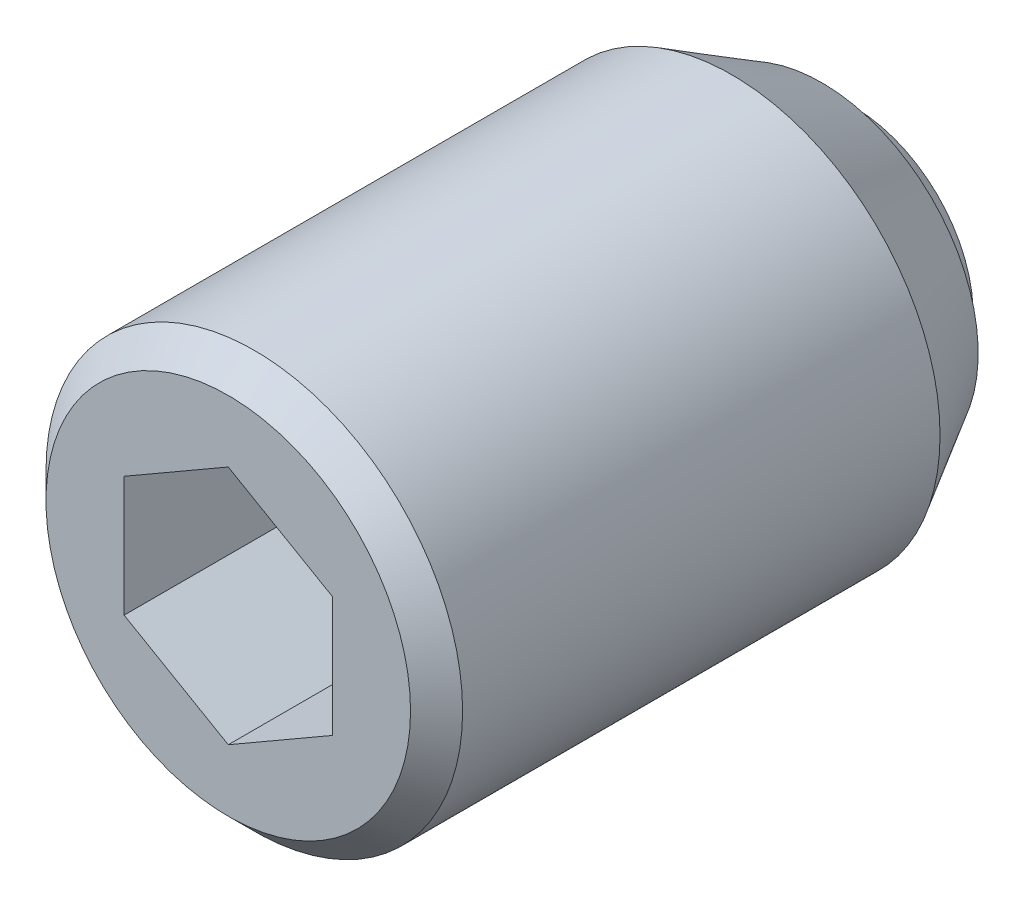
ISO-10303-21;
HEADER;
FILE_DESCRIPTION(('STEP AP214'),'2;1');
FILE_NAME('part.step','',(''),(''),'','','');
FILE_SCHEMA(('AUTOMOTIVE_DESIGN { 1 0 10303 214 1 1 1 1 }'));
ENDSEC;
DATA;
#1=APPLICATION_CONTEXT('core data for automotive mechanical design processes');
#2=APPLICATION_PROTOCOL_DEFINITION('international standard','automotive_design',2000,#1);
#3=PRODUCT_CONTEXT('',#1,'mechanical');
#4=PRODUCT('Part','Part','',(#3));
#5=PRODUCT_RELATED_PRODUCT_CATEGORY('part','',(#4));
#6=PRODUCT_DEFINITION_FORMATION('','',#4);
#7=PRODUCT_DEFINITION_CONTEXT('part definition',#1,'design');
#8=PRODUCT_DEFINITION('design','',#6,#7);
#9=PRODUCT_DEFINITION_SHAPE('','',#8);
#10=(LENGTH_UNIT() NAMED_UNIT(*) SI_UNIT(.MILLI.,.METRE.));
#11=(NAMED_UNIT(*) PLANE_ANGLE_UNIT() SI_UNIT($,.RADIAN.));
#12=(NAMED_UNIT(*) SI_UNIT($,.STERADIAN.) SOLID_ANGLE_UNIT());
#13=UNCERTAINTY_MEASURE_WITH_UNIT(LENGTH_MEASURE(1.E-05),#10,'distance_accuracy_value','');
#14=(GEOMETRIC_REPRESENTATION_CONTEXT(3) GLOBAL_UNCERTAINTY_ASSIGNED_CONTEXT((#13)) GLOBAL_UNIT_ASSIGNED_CONTEXT((#10,
#11,#12)) REPRESENTATION_CONTEXT('',''));
#15=CARTESIAN_POINT('',(0.,0.,0.));
#16=DIRECTION('',(0.,0.,1.));
#17=DIRECTION('',(1.,0.,0.));
#18=AXIS2_PLACEMENT_3D('',#15,#16,#17);
#19=CARTESIAN_POINT('',(2.,1.15470053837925,9.5));
#20=DIRECTION('',(0.5,0.86602540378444,0.));
#21=DIRECTION('',(0.86602540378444,-0.5,0.));
#22=AXIS2_PLACEMENT_3D('',#19,#20,#21);
#23=PLANE('',#22);
#24=DIRECTION('',(0.,0.,1.));
#25=VECTOR('',#24,1.);
#26=CARTESIAN_POINT('',(2.,1.15470053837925,9.5));
#27=LINE('',#26,#25);
#28=CARTESIAN_POINT('',(2.,1.15470053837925,8.));
#29=VERTEX_POINT('',#28);
#30=CARTESIAN_POINT('',(2.,1.15470053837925,12.));
#31=VERTEX_POINT('',#30);
#32=EDGE_CURVE('E68',#29,#31,#27,.T.);
#33=ORIENTED_EDGE('',*,*,#32,.T.);
#34=DIRECTION('',(-0.86602540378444,0.5,0.));
#35=VECTOR('',#34,1.);
#36=CARTESIAN_POINT('',(2.,1.15470053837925,12.));
#37=LINE('',#36,#35);
#38=CARTESIAN_POINT('',(0.,2.3094010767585,12.));
#39=VERTEX_POINT('',#38);
#40=EDGE_CURVE('E29',#31,#39,#37,.T.);
#41=ORIENTED_EDGE('',*,*,#40,.T.);
#42=DIRECTION('',(0.,0.,1.));
#43=VECTOR('',#42,1.);
#44=CARTESIAN_POINT('',(0.,2.3094010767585,9.5));
#45=LINE('',#44,#43);
#46=CARTESIAN_POINT('',(0.,2.3094010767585,8.));
#47=VERTEX_POINT('',#46);
#48=EDGE_CURVE('E80',#47,#39,#45,.T.);
#49=ORIENTED_EDGE('',*,*,#48,.F.);
#50=DIRECTION('',(-0.86602540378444,0.5,0.));
#51=VECTOR('',#50,1.);
#52=CARTESIAN_POINT('',(2.,1.15470053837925,8.));
#53=LINE('',#52,#51);
#54=EDGE_CURVE('E79',#29,#47,#53,.T.);
#55=ORIENTED_EDGE('',*,*,#54,.F.);
#56=EDGE_LOOP('',(#33,#41,#49,#55));
#57=FACE_BOUND('',#56,.T.);
#58=ADVANCED_FACE('F14',(#57),#23,.F.);
#59=CARTESIAN_POINT('',(2.,-1.15470053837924,9.5));
#60=DIRECTION('',(1.,0.,0.));
#61=DIRECTION('',(0.,0.,1.));
#62=AXIS2_PLACEMENT_3D('',#59,#60,#61);
#63=PLANE('',#62);
#64=DIRECTION('',(0.,0.,1.));
#65=VECTOR('',#64,1.);
#66=CARTESIAN_POINT('',(2.,-1.15470053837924,9.5));
#67=LINE('',#66,#65);
#68=CARTESIAN_POINT('',(2.,-1.15470053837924,8.));
#69=VERTEX_POINT('',#68);
#70=CARTESIAN_POINT('',(2.,-1.15470053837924,12.));
#71=VERTEX_POINT('',#70);
#72=EDGE_CURVE('E76',#69,#71,#67,.T.);
#73=ORIENTED_EDGE('',*,*,#72,.T.);
#74=DIRECTION('',(0.,1.,0.));
#75=VECTOR('',#74,1.);
#76=CARTESIAN_POINT('',(2.,-1.15470053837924,12.));
#77=LINE('',#76,#75);
#78=EDGE_CURVE('E75',#71,#31,#77,.T.);
#79=ORIENTED_EDGE('',*,*,#78,.T.);
#80=ORIENTED_EDGE('',*,*,#32,.F.);
#81=DIRECTION('',(0.,1.,0.));
#82=VECTOR('',#81,1.);
#83=CARTESIAN_POINT('',(2.,-1.15470053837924,8.));
#84=LINE('',#83,#82);
#85=EDGE_CURVE('E72',#69,#29,#84,.T.);
#86=ORIENTED_EDGE('',*,*,#85,.F.);
#87=EDGE_LOOP('',(#73,#79,#80,#86));
#88=FACE_BOUND('',#87,.T.);
#89=ADVANCED_FACE('F70',(#88),#63,.F.);
#90=CARTESIAN_POINT('',(2.,-1.15470053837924,9.5));
#91=DIRECTION('',(-0.5,0.866025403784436,0.));
#92=DIRECTION('',(0.866025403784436,0.5,0.));
#93=AXIS2_PLACEMENT_3D('',#90,#91,#92);
#94=PLANE('',#93);
#95=DIRECTION('',(0.,0.,1.));
#96=VECTOR('',#95,1.);
#97=CARTESIAN_POINT('',(0.,-2.30940107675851,9.5));
#98=LINE('',#97,#96);
#99=CARTESIAN_POINT('',(0.,-2.30940107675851,8.));
#100=VERTEX_POINT('',#99);
#101=CARTESIAN_POINT('',(0.,-2.30940107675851,12.));
#102=VERTEX_POINT('',#101);
#103=EDGE_CURVE('E122',#100,#102,#98,.T.);
#104=ORIENTED_EDGE('',*,*,#103,.T.);
#105=DIRECTION('',(-0.866025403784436,-0.5,0.));
#106=VECTOR('',#105,1.);
#107=CARTESIAN_POINT('',(2.,-1.15470053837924,12.));
#108=LINE('',#107,#106);
#109=EDGE_CURVE('E113',#71,#102,#108,.T.);
#110=ORIENTED_EDGE('',*,*,#109,.F.);
#111=ORIENTED_EDGE('',*,*,#72,.F.);
#112=DIRECTION('',(0.866025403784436,0.5,0.));
#113=VECTOR('',#112,1.);
#114=CARTESIAN_POINT('',(0.,-2.30940107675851,8.));
#115=LINE('',#114,#113);
#116=EDGE_CURVE('E89',#100,#69,#115,.T.);
#117=ORIENTED_EDGE('',*,*,#116,.F.);
#118=EDGE_LOOP('',(#104,#110,#111,#117));
#119=FACE_BOUND('',#118,.T.);
#120=ADVANCED_FACE('F147',(#119),#94,.T.);
#121=CARTESIAN_POINT('',(-2.,-1.15470053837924,9.5));
#122=DIRECTION('',(-0.5,-0.866025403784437,0.));
#123=DIRECTION('',(-0.866025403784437,0.5,0.));
#124=AXIS2_PLACEMENT_3D('',#121,#122,#123);
#125=PLANE('',#124);
#126=DIRECTION('',(0.,0.,1.));
#127=VECTOR('',#126,1.);
#128=CARTESIAN_POINT('',(-2.,-1.15470053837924,9.5));
#129=LINE('',#128,#127);
#130=CARTESIAN_POINT('',(-2.,-1.15470053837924,8.));
#131=VERTEX_POINT('',#130);
#132=CARTESIAN_POINT('',(-2.,-1.15470053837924,12.));
#133=VERTEX_POINT('',#132);
#134=EDGE_CURVE('E120',#131,#133,#129,.T.);
#135=ORIENTED_EDGE('',*,*,#134,.T.);
#136=DIRECTION('',(0.866025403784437,-0.5,0.));
#137=VECTOR('',#136,1.);
#138=CARTESIAN_POINT('',(-2.,-1.15470053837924,12.));
#139=LINE('',#138,#137);
#140=EDGE_CURVE('E111',#133,#102,#139,.T.);
#141=ORIENTED_EDGE('',*,*,#140,.T.);
#142=ORIENTED_EDGE('',*,*,#103,.F.);
#143=DIRECTION('',(0.866025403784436,-0.5,0.));
#144=VECTOR('',#143,1.);
#145=CARTESIAN_POINT('',(-2.,-1.15470053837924,8.));
#146=LINE('',#145,#144);
#147=EDGE_CURVE('E101',#131,#100,#146,.T.);
#148=ORIENTED_EDGE('',*,*,#147,.F.);
#149=EDGE_LOOP('',(#135,#141,#142,#148));
#150=FACE_BOUND('',#149,.T.);
#151=ADVANCED_FACE('F157',(#150),#125,.F.);
#152=CARTESIAN_POINT('',(-2.,-1.15470053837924,9.5));
#153=DIRECTION('',(1.,0.,0.));
#154=DIRECTION('',(0.,0.,1.));
#155=AXIS2_PLACEMENT_3D('',#152,#153,#154);
#156=PLANE('',#155);
#157=DIRECTION('',(0.,0.,1.));
#158=VECTOR('',#157,1.);
#159=CARTESIAN_POINT('',(-2.,1.15470053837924,9.5));
#160=LINE('',#159,#158);
#161=CARTESIAN_POINT('',(-2.,1.15470053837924,8.));
#162=VERTEX_POINT('',#161);
#163=CARTESIAN_POINT('',(-2.,1.15470053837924,12.));
#164=VERTEX_POINT('',#163);
#165=EDGE_CURVE('E37',#162,#164,#160,.T.);
#166=ORIENTED_EDGE('',*,*,#165,.T.);
#167=DIRECTION('',(0.,1.,0.));
#168=VECTOR('',#167,1.);
#169=CARTESIAN_POINT('',(-2.,-1.15470053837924,12.));
#170=LINE('',#169,#168);
#171=EDGE_CURVE('E108',#133,#164,#170,.T.);
#172=ORIENTED_EDGE('',*,*,#171,.F.);
#173=ORIENTED_EDGE('',*,*,#134,.F.);
#174=DIRECTION('',(0.,-1.,0.));
#175=VECTOR('',#174,1.);
#176=CARTESIAN_POINT('',(-2.,1.15470053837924,8.));
#177=LINE('',#176,#175);
#178=EDGE_CURVE('E98',#162,#131,#177,.T.);
#179=ORIENTED_EDGE('',*,*,#178,.F.);
#180=EDGE_LOOP('',(#166,#172,#173,#179));
#181=FACE_BOUND('',#180,.T.);
#182=ADVANCED_FACE('F153',(#181),#156,.T.);
#183=CARTESIAN_POINT('',(-2.,1.15470053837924,9.5));
#184=DIRECTION('',(0.5,-0.866025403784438,0.));
#185=DIRECTION('',(-0.866025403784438,-0.5,0.));
#186=AXIS2_PLACEMENT_3D('',#183,#184,#185);
#187=PLANE('',#186);
#188=ORIENTED_EDGE('',*,*,#165,.F.);
#189=DIRECTION('',(-0.866025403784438,-0.5,0.));
#190=VECTOR('',#189,1.);
#191=CARTESIAN_POINT('',(0.,2.3094010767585,8.));
#192=LINE('',#191,#190);
#193=EDGE_CURVE('E84',#47,#162,#192,.T.);
#194=ORIENTED_EDGE('',*,*,#193,.F.);
#195=ORIENTED_EDGE('',*,*,#48,.T.);
#196=DIRECTION('',(0.866025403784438,0.5,0.));
#197=VECTOR('',#196,1.);
#198=CARTESIAN_POINT('',(-2.,1.15470053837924,12.));
#199=LINE('',#198,#197);
#200=EDGE_CURVE('E105',#164,#39,#199,.T.);
#201=ORIENTED_EDGE('',*,*,#200,.F.);
#202=EDGE_LOOP('',(#188,#194,#195,#201));
#203=FACE_BOUND('',#202,.T.);
#204=ADVANCED_FACE('F150',(#203),#187,.T.);
#205=CARTESIAN_POINT('',(0.,0.,11.75));
#206=DIRECTION('',(0.,0.,-1.));
#207=DIRECTION('',(1.,0.,0.));
#208=AXIS2_PLACEMENT_3D('',#205,#206,#207);
#209=CYLINDRICAL_SURFACE('',#208,4.);
#210=CARTESIAN_POINT('',(0.,0.,11.5));
#211=DIRECTION('',(0.,0.,-1.));
#212=DIRECTION('',(1.,0.,0.));
#213=AXIS2_PLACEMENT_3D('',#210,#211,#212);
#214=CIRCLE('',#213,4.);
#215=CARTESIAN_POINT('',(4.,0.,11.5));
#216=VERTEX_POINT('',#215);
#217=EDGE_CURVE('E9',#216,#216,#214,.T.);
#218=ORIENTED_EDGE('',*,*,#217,.T.);
#219=EDGE_LOOP('',(#218));
#220=FACE_BOUND('',#219,.T.);
#221=CARTESIAN_POINT('',(0.,0.,2.33205080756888));
#222=DIRECTION('',(0.,0.,-1.));
#223=DIRECTION('',(-1.,0.,0.));
#224=AXIS2_PLACEMENT_3D('',#221,#222,#223);
#225=CIRCLE('',#224,4.);
#226=CARTESIAN_POINT('',(-4.,0.,2.33205080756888));
#227=VERTEX_POINT('',#226);
#228=EDGE_CURVE('E260',#227,#227,#225,.T.);
#229=ORIENTED_EDGE('',*,*,#228,.F.);
#230=EDGE_LOOP('',(#229));
#231=FACE_BOUND('',#230,.T.);
#232=ADVANCED_FACE('F16',(#220,#231),#209,.T.);
#233=CARTESIAN_POINT('',(0.,0.,11.5));
#234=DIRECTION('',(0.,0.,-1.));
#235=DIRECTION('',(1.,0.,0.));
#236=AXIS2_PLACEMENT_3D('',#233,#234,#235);
#237=CONICAL_SURFACE('',#236,4.,0.785398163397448);
#238=CARTESIAN_POINT('',(0.,0.,12.));
#239=DIRECTION('',(0.,0.,-1.));
#240=DIRECTION('',(1.,0.,0.));
#241=AXIS2_PLACEMENT_3D('',#238,#239,#240);
#242=CIRCLE('',#241,3.5);
#243=CARTESIAN_POINT('',(3.5,0.,12.));
#244=VERTEX_POINT('',#243);
#245=EDGE_CURVE('E22',#244,#244,#242,.T.);
#246=ORIENTED_EDGE('',*,*,#245,.T.);
#247=EDGE_LOOP('',(#246));
#248=FACE_BOUND('',#247,.T.);
#249=ORIENTED_EDGE('',*,*,#217,.F.);
#250=EDGE_LOOP('',(#249));
#251=FACE_BOUND('',#250,.T.);
#252=ADVANCED_FACE('F127',(#248,#251),#237,.T.);
#253=CARTESIAN_POINT('',(0.,0.,12.));
#254=DIRECTION('',(0.,0.,-1.));
#255=DIRECTION('',(1.,0.,0.));
#256=AXIS2_PLACEMENT_3D('',#253,#254,#255);
#257=PLANE('',#256);
#258=ORIENTED_EDGE('',*,*,#200,.T.);
#259=ORIENTED_EDGE('',*,*,#40,.F.);
#260=ORIENTED_EDGE('',*,*,#78,.F.);
#261=ORIENTED_EDGE('',*,*,#109,.T.);
#262=ORIENTED_EDGE('',*,*,#140,.F.);
#263=ORIENTED_EDGE('',*,*,#171,.T.);
#264=EDGE_LOOP('',(#258,#259,#260,#261,#262,#263));
#265=FACE_BOUND('',#264,.T.);
#266=ORIENTED_EDGE('',*,*,#245,.F.);
#267=EDGE_LOOP('',(#266));
#268=FACE_BOUND('',#267,.T.);
#269=ADVANCED_FACE('F130',(#265,#268),#257,.F.);
#270=CARTESIAN_POINT('',(2.,1.15470053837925,8.));
#271=DIRECTION('',(0.,0.,1.));
#272=DIRECTION('',(1.,0.,0.));
#273=AXIS2_PLACEMENT_3D('',#270,#271,#272);
#274=PLANE('',#273);
#275=ORIENTED_EDGE('',*,*,#85,.T.);
#276=ORIENTED_EDGE('',*,*,#54,.T.);
#277=ORIENTED_EDGE('',*,*,#193,.T.);
#278=ORIENTED_EDGE('',*,*,#178,.T.);
#279=ORIENTED_EDGE('',*,*,#147,.T.);
#280=ORIENTED_EDGE('',*,*,#116,.T.);
#281=EDGE_LOOP('',(#275,#276,#277,#278,#279,#280));
#282=FACE_BOUND('',#281,.T.);
#283=ADVANCED_FACE('F86',(#282),#274,.T.);
#284=CARTESIAN_POINT('',(0.,0.,0.));
#285=DIRECTION('',(0.,0.,-1.));
#286=DIRECTION('',(-1.,0.,0.));
#287=AXIS2_PLACEMENT_3D('',#284,#285,#286);
#288=PLANE('',#287);
#289=CARTESIAN_POINT('',(0.,0.,0.));
#290=DIRECTION('',(0.,0.,-1.));
#291=DIRECTION('',(-1.,0.,0.));
#292=AXIS2_PLACEMENT_3D('',#289,#290,#291);
#293=CIRCLE('',#292,2.30488611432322);
#294=CARTESIAN_POINT('',(-2.30488611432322,0.,0.));
#295=VERTEX_POINT('',#294);
#296=EDGE_CURVE('E90',#295,#295,#293,.T.);
#297=ORIENTED_EDGE('',*,*,#296,.T.);
#298=EDGE_LOOP('',(#297));
#299=FACE_BOUND('',#298,.T.);
#300=ADVANCED_FACE('F139',(#299),#288,.T.);
#301=CARTESIAN_POINT('',(0.,0.,1.5));
#302=DIRECTION('',(0.,0.,-1.));
#303=DIRECTION('',(-1.,0.,0.));
#304=AXIS2_PLACEMENT_3D('',#301,#302,#303);
#305=SPHERICAL_SURFACE('',#304,2.75);
#306=CARTESIAN_POINT('',(0.,0.,0.6));
#307=DIRECTION('',(0.,0.,-1.));
#308=DIRECTION('',(-1.,0.,0.));
#309=AXIS2_PLACEMENT_3D('',#306,#307,#308);
#310=CIRCLE('',#309,2.59855729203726);
#311=CARTESIAN_POINT('',(-2.59855729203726,0.,0.6));
#312=VERTEX_POINT('',#311);
#313=EDGE_CURVE('E93',#312,#312,#310,.T.);
#314=CARTESIAN_POINT('',(-2.59855729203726,0.,0.6));
#315=CARTESIAN_POINT('',(-2.59627433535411,0.,0.593408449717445));
#316=CARTESIAN_POINT('',(-2.59396629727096,0.,0.586825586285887));
#317=CARTESIAN_POINT('',(-2.58930019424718,0.,0.573677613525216));
#318=CARTESIAN_POINT('',(-2.58694212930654,0.,0.567112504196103));
#319=CARTESIAN_POINT('',(-2.58217610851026,0.,0.55400042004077));
#320=CARTESIAN_POINT('',(-2.57976815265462,0.,0.54745344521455));
#321=CARTESIAN_POINT('',(-2.57490248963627,0.,0.534378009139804));
#322=CARTESIAN_POINT('',(-2.57244478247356,0.,0.527849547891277));
#323=CARTESIAN_POINT('',(-2.56747975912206,0.,0.514811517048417));
#324=CARTESIAN_POINT('',(-2.56497244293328,0.,0.508301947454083));
#325=CARTESIAN_POINT('',(-2.55990834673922,0.,0.495302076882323));
#326=CARTESIAN_POINT('',(-2.55735156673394,0.,0.488811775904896));
#327=CARTESIAN_POINT('',(-2.55218869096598,0.,0.475850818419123));
#328=CARTESIAN_POINT('',(-2.54958259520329,0.,0.469380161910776));
#329=CARTESIAN_POINT('',(-2.54432123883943,0.,0.456458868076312));
#330=CARTESIAN_POINT('',(-2.54166597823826,0.,0.450008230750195));
#331=CARTESIAN_POINT('',(-2.53630644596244,0.,0.437127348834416));
#332=CARTESIAN_POINT('',(-2.53360217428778,0.,0.430697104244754));
#333=CARTESIAN_POINT('',(-2.52814477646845,0.,0.417857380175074));
#334=CARTESIAN_POINT('',(-2.52539165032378,0.,0.411447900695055));
#335=CARTESIAN_POINT('',(-2.51983670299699,0.,0.398650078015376));
#336=CARTESIAN_POINT('',(-2.51703488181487,0.,0.392261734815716));
#337=CARTESIAN_POINT('',(-2.51138270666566,0.,0.379506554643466));
#338=CARTESIAN_POINT('',(-2.50853235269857,0.,0.373139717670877));
#339=CARTESIAN_POINT('',(-2.50278327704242,0.,0.360427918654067));
#340=CARTESIAN_POINT('',(-2.49988455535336,0.,0.354082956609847));
#341=CARTESIAN_POINT('',(-2.49403891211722,0.,0.3414152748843));
#342=CARTESIAN_POINT('',(-2.49109199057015,0.,0.335092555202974));
#343=CARTESIAN_POINT('',(-2.48515011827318,0.,0.322469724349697));
#344=CARTESIAN_POINT('',(-2.48215516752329,0.,0.316169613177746));
#345=CARTESIAN_POINT('',(-2.47611741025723,0.,0.303592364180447));
#346=CARTESIAN_POINT('',(-2.47307460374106,0.,0.2973152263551));
#347=CARTESIAN_POINT('',(-2.46694131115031,0.,0.284784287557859));
#348=CARTESIAN_POINT('',(-2.46385082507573,0.,0.278530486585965));
#349=CARTESIAN_POINT('',(-2.45762235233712,0.,0.266046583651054));
#350=CARTESIAN_POINT('',(-2.45448436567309,0.,0.259816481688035));
#351=CARTESIAN_POINT('',(-2.44816107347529,0.,0.247380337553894));
#352=CARTESIAN_POINT('',(-2.44497576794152,0.,0.241174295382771));
#353=CARTESIAN_POINT('',(-2.43855802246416,0.,0.228786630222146));
#354=CARTESIAN_POINT('',(-2.43532558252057,0.,0.222605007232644));
#355=CARTESIAN_POINT('',(-2.42881375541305,0.,0.210266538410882));
#356=CARTESIAN_POINT('',(-2.42553436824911,0.,0.204109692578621));
#357=CARTESIAN_POINT('',(-2.41892883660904,0.,0.191821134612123));
#358=CARTESIAN_POINT('',(-2.41560269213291,0.,0.185689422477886));
#359=CARTESIAN_POINT('',(-2.40890383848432,0.,0.173451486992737));
#360=CARTESIAN_POINT('',(-2.40553112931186,0.,0.167345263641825));
#361=CARTESIAN_POINT('',(-2.39873934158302,0.,0.155158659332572));
#362=CARTESIAN_POINT('',(-2.39532026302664,0.,0.149078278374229));
#363=CARTESIAN_POINT('',(-2.38843593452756,0.,0.136943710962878));
#364=CARTESIAN_POINT('',(-2.38497068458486,0.,0.13088952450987));
#365=CARTESIAN_POINT('',(-2.37799421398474,0.,0.11880769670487));
#366=CARTESIAN_POINT('',(-2.37448299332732,0.,0.11278005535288));
#367=CARTESIAN_POINT('',(-2.36741478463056,0.,0.100751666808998));
#368=CARTESIAN_POINT('',(-2.36385779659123,0.,0.094750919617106));
#369=CARTESIAN_POINT('',(-2.35669825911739,0.,0.0827766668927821));
#370=CARTESIAN_POINT('',(-2.35309570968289,0.,0.0768031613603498));
#371=CARTESIAN_POINT('',(-2.34584525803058,0.,0.0648837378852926));
#372=CARTESIAN_POINT('',(-2.34219735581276,0.,0.0589378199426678));
#373=CARTESIAN_POINT('',(-2.33485640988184,0.,0.0470739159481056));
#374=CARTESIAN_POINT('',(-2.33116336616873,0.,0.0411559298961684));
#375=CARTESIAN_POINT('',(-2.32373235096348,0.,0.0293482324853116));
#376=CARTESIAN_POINT('',(-2.31999437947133,0.,0.023458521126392));
#377=CARTESIAN_POINT('',(-2.31247372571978,0.,0.0117077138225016));
#378=CARTESIAN_POINT('',(-2.30869104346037,0.,0.00584661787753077));
#379=CARTESIAN_POINT('',(-2.30488611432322,0.,0.));
#380=B_SPLINE_CURVE_WITH_KNOTS('',3,(#314,#315,#316,#317,#318,#319,#320,#321,#322,#323,#324,
#325,#326,#327,#328,#329,#330,#331,#332,#333,#334,#335,#336,#337,#338,#339,#340,#341,#342,#343,
#344,#345,#346,#347,#348,#349,#350,#351,#352,#353,#354,#355,#356,#357,#358,#359,#360,#361,#362,
#363,#364,#365,#366,#367,#368,#369,#370,#371,#372,#373,#374,#375,#376,#377,#378,#379),
.UNSPECIFIED.,.F.,.F.,(4,2,2,2,2,2,2,2,2,2,2,2,2,2,2,2,2,2,2,2,2,2,2,2,2,2,2,2,2,2,2,2,4),(0.,
0.0209270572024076,0.0418541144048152,0.0627811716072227,0.0837082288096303,0.104635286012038,
0.125562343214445,0.146489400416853,0.16741645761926,0.188343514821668,0.209270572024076,
0.230197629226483,0.251124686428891,0.272051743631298,0.292978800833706,0.313905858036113,
0.334832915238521,0.355759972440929,0.376687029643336,0.397614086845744,0.418541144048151,
0.439468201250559,0.460395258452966,0.481322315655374,0.502249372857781,0.523176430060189,
0.544103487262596,0.565030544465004,0.585957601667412,0.606884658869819,0.627811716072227,
0.648738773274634,0.669665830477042),.UNSPECIFIED.);
#381=EDGE_CURVE('BSEAM223',#312,#295,#380,.T.);
#382=ORIENTED_EDGE('',*,*,#313,.T.);
#383=ORIENTED_EDGE('',*,*,#296,.F.);
#384=ORIENTED_EDGE('',*,*,#381,.T.);
#385=ORIENTED_EDGE('',*,*,#381,.F.);
#386=EDGE_LOOP('',(#382,#384,#383,#385));
#387=FACE_BOUND('',#386,.T.);
#388=ADVANCED_FACE('F223',(#387),#305,.T.);
#389=CARTESIAN_POINT('',(-2.59855729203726,0.,0.6));
#390=DIRECTION('',(0.,0.,-1.));
#391=DIRECTION('',(-1.,0.,0.));
#392=AXIS2_PLACEMENT_3D('',#389,#390,#391);
#393=PLANE('',#392);
#394=CARTESIAN_POINT('',(0.,0.,0.6));
#395=DIRECTION('',(0.,0.,-1.));
#396=DIRECTION('',(-1.,0.,0.));
#397=AXIS2_PLACEMENT_3D('',#394,#395,#396);
#398=CIRCLE('',#397,3.);
#399=CARTESIAN_POINT('',(-3.,0.,0.6));
#400=VERTEX_POINT('',#399);
#401=EDGE_CURVE('E263',#400,#400,#398,.T.);
#402=ORIENTED_EDGE('',*,*,#401,.T.);
#403=EDGE_LOOP('',(#402));
#404=FACE_BOUND('',#403,.T.);
#405=ORIENTED_EDGE('',*,*,#313,.F.);
#406=EDGE_LOOP('',(#405));
#407=FACE_BOUND('',#406,.T.);
#408=ADVANCED_FACE('F232',(#404,#407),#393,.T.);
#409=CARTESIAN_POINT('',(0.,0.,0.6));
#410=DIRECTION('',(0.,0.,1.));
#411=DIRECTION('',(1.,0.,0.));
#412=AXIS2_PLACEMENT_3D('',#409,#410,#411);
#413=CONICAL_SURFACE('',#412,3.,0.523598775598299);
#414=ORIENTED_EDGE('',*,*,#228,.T.);
#415=EDGE_LOOP('',(#414));
#416=FACE_BOUND('',#415,.T.);
#417=ORIENTED_EDGE('',*,*,#401,.F.);
#418=EDGE_LOOP('',(#417));
#419=FACE_BOUND('',#418,.T.);
#420=ADVANCED_FACE('F242',(#416,#419),#413,.T.);
#421=CLOSED_SHELL('',(#58,#89,#120,#151,#182,#204,#232,#252,#269,#283,#300,#388,#408,#420));
#422=MANIFOLD_SOLID_BREP('B1',#421);
#423=ADVANCED_BREP_SHAPE_REPRESENTATION('',(#18,#422),#14);
#424=SHAPE_DEFINITION_REPRESENTATION(#9,#423);
ENDSEC;
END-ISO-10303-21;
